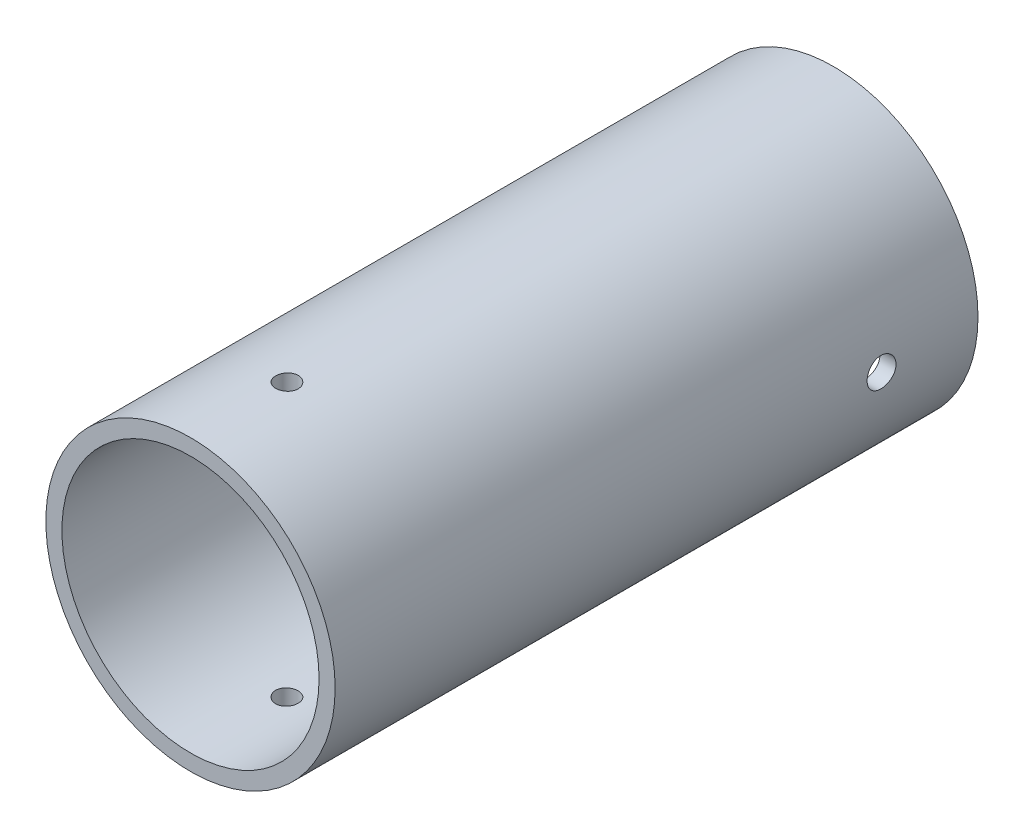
from build123d import *

# Parameters (mm, degrees)
SKETCH1_R          = 22.5
SKETCH1_R_2        = 20
EXTRUDE1_DEPTH     = 100
SKETCH2_R          = 2.25
CUT_EXTRUDE1_DEPTH = 100
SKETCH3_R          = 1.75
CUT_EXTRUDE2_DEPTH = 50
SKETCH4_R          = 0.001
CUT_EXTRUDE3_DEPTH = 30


with BuildPart() as part:
    # Sketch1 → Extrude1 (new body)
    with BuildSketch(Plane.XY):
        Circle(SKETCH1_R)
        Circle(SKETCH1_R_2, mode=Mode.SUBTRACT)
    extrude(amount=-EXTRUDE1_DEPTH)

    # Sketch2 → Cut-Extrude1 (cut)
    with BuildSketch(Plane(origin=(0, 0, 0), x_dir=(0, 0, -1), z_dir=(1, 0, 0))):
        with Locations(Location((85, 0, 0), (0, 0, 180))):
            Circle(SKETCH2_R)
    extrude(amount=CUT_EXTRUDE1_DEPTH, mode=Mode.SUBTRACT)

    # Sketch3 → Cut-Extrude2 (cut, symmetric)
    with BuildSketch(Plane(origin=(0, 0, 0), x_dir=(1, 0, 0), z_dir=(0, 1, 0))):
        with Locations(Location((0, 15, 0), (0, 0, 270))):
            Circle(SKETCH3_R)
    extrude(amount=CUT_EXTRUDE2_DEPTH, both=True, mode=Mode.SUBTRACT)

    # Sketch4 → Cut-Extrude3 (cut)
    with BuildSketch(Plane(origin=(0, 0, 0), x_dir=(0, 0, -1), z_dir=(1, 0, 0))):
        with Locations((52.590998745, 0)):
            Circle(SKETCH4_R)
    extrude(amount=-CUT_EXTRUDE3_DEPTH, mode=Mode.SUBTRACT)


solid = part.part
